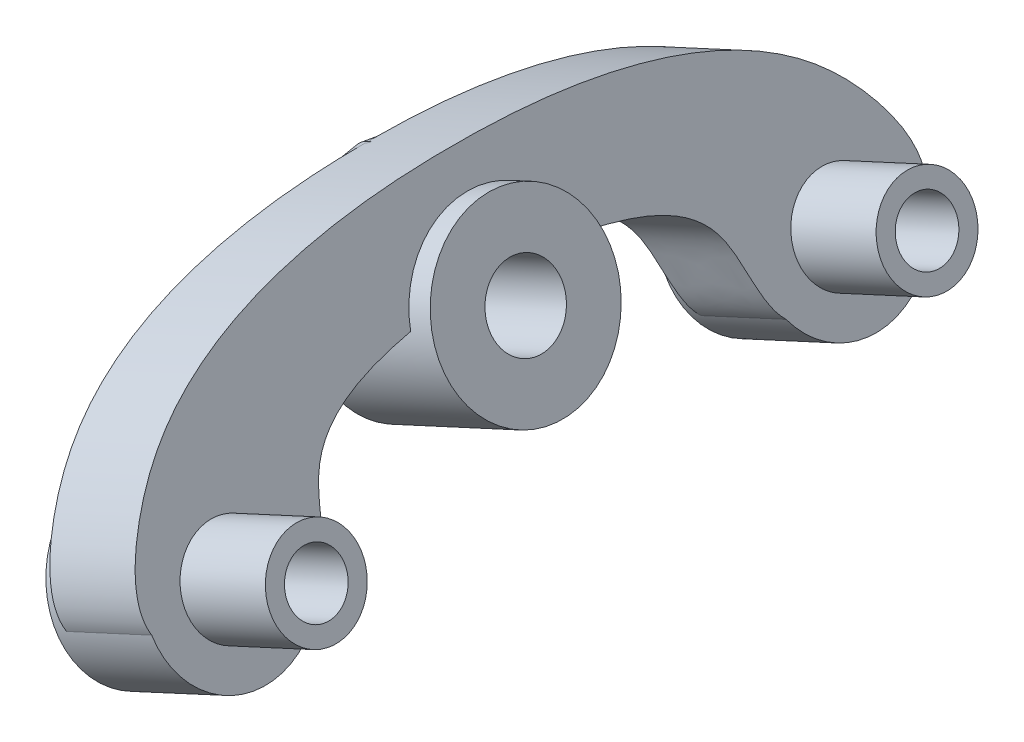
ISO-10303-21;
HEADER;
FILE_DESCRIPTION(('STEP AP214'),'2;1');
FILE_NAME('part.step','',(''),(''),'','','');
FILE_SCHEMA(('AUTOMOTIVE_DESIGN { 1 0 10303 214 1 1 1 1 }'));
ENDSEC;
DATA;
#1=APPLICATION_CONTEXT('core data for automotive mechanical design processes');
#2=APPLICATION_PROTOCOL_DEFINITION('international standard','automotive_design',2000,#1);
#3=PRODUCT_CONTEXT('',#1,'mechanical');
#4=PRODUCT('Part','Part','',(#3));
#5=PRODUCT_RELATED_PRODUCT_CATEGORY('part','',(#4));
#6=PRODUCT_DEFINITION_FORMATION('','',#4);
#7=PRODUCT_DEFINITION_CONTEXT('part definition',#1,'design');
#8=PRODUCT_DEFINITION('design','',#6,#7);
#9=PRODUCT_DEFINITION_SHAPE('','',#8);
#10=(LENGTH_UNIT() NAMED_UNIT(*) SI_UNIT(.MILLI.,.METRE.));
#11=(NAMED_UNIT(*) PLANE_ANGLE_UNIT() SI_UNIT($,.RADIAN.));
#12=(NAMED_UNIT(*) SI_UNIT($,.STERADIAN.) SOLID_ANGLE_UNIT());
#13=UNCERTAINTY_MEASURE_WITH_UNIT(LENGTH_MEASURE(1.E-05),#10,'distance_accuracy_value','');
#14=(GEOMETRIC_REPRESENTATION_CONTEXT(3) GLOBAL_UNCERTAINTY_ASSIGNED_CONTEXT((#13)) GLOBAL_UNIT_ASSIGNED_CONTEXT((#10,
#11,#12)) REPRESENTATION_CONTEXT('',''));
#15=CARTESIAN_POINT('',(0.,0.,0.));
#16=DIRECTION('',(0.,0.,1.));
#17=DIRECTION('',(1.,0.,0.));
#18=AXIS2_PLACEMENT_3D('',#15,#16,#17);
#19=CARTESIAN_POINT('',(427.544395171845,381.491929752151,-33.));
#20=CARTESIAN_POINT('',(429.18114572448,377.94563688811,-31.5159154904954));
#21=CARTESIAN_POINT('',(430.475313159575,375.141607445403,-18.2044817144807));
#22=CARTESIAN_POINT('',(425.340498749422,386.267038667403,-18.333257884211));
#23=CARTESIAN_POINT('',(423.908373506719,389.369976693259,-9.18901968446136));
#24=CARTESIAN_POINT('',(423.697685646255,389.826467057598,0.));
#25=CARTESIAN_POINT('',(423.908373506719,389.369976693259,9.18901968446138));
#26=CARTESIAN_POINT('',(425.340498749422,386.267038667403,18.333257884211));
#27=CARTESIAN_POINT('',(430.475313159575,375.141607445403,18.2044817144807));
#28=CARTESIAN_POINT('',(428.731583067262,378.919689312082,36.1399875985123));
#29=CARTESIAN_POINT('',(424.078552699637,389.001255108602,30.9280904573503));
#30=CARTESIAN_POINT('',(421.714104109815,394.124227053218,23.7008760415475));
#31=CARTESIAN_POINT('',(420.404830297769,396.960986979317,12.5144980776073));
#32=CARTESIAN_POINT('',(420.108002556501,397.604113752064,0.));
#33=CARTESIAN_POINT('',(420.404830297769,396.960986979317,-12.5144980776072));
#34=CARTESIAN_POINT('',(421.714104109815,394.124227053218,-23.7008760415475));
#35=CARTESIAN_POINT('',(424.078552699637,389.001255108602,-30.9280904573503));
#36=CARTESIAN_POINT('',(426.651273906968,383.427025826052,-33.8098163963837));
#37=CARTESIAN_POINT('',(427.544395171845,381.491929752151,-33.));
#38=B_SPLINE_CURVE_WITH_KNOTS('',3,(#19,#20,#21,#22,#23,#24,#25,#26,#27,#28,#29,#30,#31,#32,#33,
#34,#35,#36,#37),.UNSPECIFIED.,.T.,.F.,(4,1,1,1,1,1,1,1,1,1,1,1,1,1,1,1,4),(0.,
0.083228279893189,0.130737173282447,0.181031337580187,0.243724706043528,0.306418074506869,
0.356712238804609,0.404221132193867,0.487449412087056,0.532864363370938,0.590377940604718,
0.662388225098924,0.743724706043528,0.825061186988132,0.897071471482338,0.954585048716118,1.),.UNSPECIFIED.);
#39=DIRECTION('',(0.907959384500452,0.419058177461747,0.));
#40=VECTOR('',#39,1.);
#41=SURFACE_OF_LINEAR_EXTRUSION('',#38,#40);
#42=CARTESIAN_POINT('',(434.808070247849,384.844395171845,-33.));
#43=CARTESIAN_POINT('',(436.444820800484,381.298102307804,-31.5159154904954));
#44=CARTESIAN_POINT('',(437.738988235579,378.494072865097,-18.2044817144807));
#45=CARTESIAN_POINT('',(432.604173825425,389.619504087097,-18.333257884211));
#46=CARTESIAN_POINT('',(431.172048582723,392.722442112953,-9.18901968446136));
#47=CARTESIAN_POINT('',(430.961360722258,393.178932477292,0.));
#48=CARTESIAN_POINT('',(431.172048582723,392.722442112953,9.18901968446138));
#49=CARTESIAN_POINT('',(432.604173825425,389.619504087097,18.333257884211));
#50=CARTESIAN_POINT('',(437.738988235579,378.494072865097,18.2044817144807));
#51=CARTESIAN_POINT('',(435.995258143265,382.272154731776,36.1399875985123));
#52=CARTESIAN_POINT('',(431.342227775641,392.353720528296,30.9280904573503));
#53=CARTESIAN_POINT('',(428.977779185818,397.476692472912,23.7008760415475));
#54=CARTESIAN_POINT('',(427.668505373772,400.313452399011,12.5144980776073));
#55=CARTESIAN_POINT('',(427.371677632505,400.956579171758,0.));
#56=CARTESIAN_POINT('',(427.668505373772,400.313452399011,-12.5144980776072));
#57=CARTESIAN_POINT('',(428.977779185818,397.476692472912,-23.7008760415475));
#58=CARTESIAN_POINT('',(431.342227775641,392.353720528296,-30.9280904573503));
#59=CARTESIAN_POINT('',(433.914948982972,386.779491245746,-33.8098163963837));
#60=CARTESIAN_POINT('',(434.808070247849,384.844395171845,-33.));
#61=B_SPLINE_CURVE_WITH_KNOTS('',3,(#42,#43,#44,#45,#46,#47,#48,#49,#50,#51,#52,#53,#54,#55,#56,
#57,#58,#59,#60),.UNSPECIFIED.,.T.,.F.,(4,1,1,1,1,1,1,1,1,1,1,1,1,1,1,1,4),(0.,
0.083228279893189,0.130737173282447,0.181031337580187,0.243724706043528,0.306418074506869,
0.356712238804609,0.404221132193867,0.487449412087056,0.532864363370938,0.590377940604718,
0.662388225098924,0.743724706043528,0.825061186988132,0.897071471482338,0.954585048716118,1.),.UNSPECIFIED.);
#62=CARTESIAN_POINT('',(431.238414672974,392.578648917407,7.34471380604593));
#63=VERTEX_POINT('',#62);
#64=CARTESIAN_POINT('',(436.00615270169,382.248549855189,19.8585671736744));
#65=VERTEX_POINT('',#64);
#66=EDGE_CURVE('E226',#63,#65,#61,.T.);
#67=ORIENTED_EDGE('',*,*,#66,.T.);
#68=DIRECTION('',(0.907959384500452,0.419058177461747,0.));
#69=VECTOR('',#68,1.);
#70=CARTESIAN_POINT('',(428.742477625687,378.896084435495,19.8585671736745));
#71=LINE('',#70,#69);
#72=CARTESIAN_POINT('',(428.742477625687,378.896084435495,19.8585671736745));
#73=VERTEX_POINT('',#72);
#74=EDGE_CURVE('E224',#65,#73,#71,.F.);
#75=ORIENTED_EDGE('',*,*,#74,.T.);
#76=CARTESIAN_POINT('',(423.97473959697,389.226183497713,7.34471380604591));
#77=VERTEX_POINT('',#76);
#78=EDGE_CURVE('E213',#77,#73,#38,.T.);
#79=ORIENTED_EDGE('',*,*,#78,.F.);
#80=DIRECTION('',(0.907959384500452,0.419058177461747,0.));
#81=VECTOR('',#80,1.);
#82=CARTESIAN_POINT('',(423.974739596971,389.226183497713,7.34471380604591));
#83=LINE('',#82,#81);
#84=EDGE_CURVE('E277',#77,#63,#83,.T.);
#85=ORIENTED_EDGE('',*,*,#84,.T.);
#86=EDGE_LOOP('',(#67,#75,#79,#85));
#87=FACE_BOUND('',#86,.T.);
#88=ADVANCED_FACE('F121',(#87),#41,.F.);
#89=CARTESIAN_POINT('',(427.568265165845,381.440211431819,32.9778072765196));
#90=VERTEX_POINT('',#89);
#91=CARTESIAN_POINT('',(420.210935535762,397.381092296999,0.178646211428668));
#92=VERTEX_POINT('',#91);
#93=EDGE_CURVE('E221',#90,#92,#38,.T.);
#94=ORIENTED_EDGE('',*,*,#93,.F.);
#95=DIRECTION('',(0.907959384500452,0.419058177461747,0.));
#96=VECTOR('',#95,1.);
#97=CARTESIAN_POINT('',(427.568265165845,381.440211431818,32.9778072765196));
#98=LINE('',#97,#96);
#99=CARTESIAN_POINT('',(434.831940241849,384.792676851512,32.9778072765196));
#100=VERTEX_POINT('',#99);
#101=EDGE_CURVE('E147',#90,#100,#98,.T.);
#102=ORIENTED_EDGE('',*,*,#101,.T.);
#103=CARTESIAN_POINT('',(434.831940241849,384.792676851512,-32.9778072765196));
#104=VERTEX_POINT('',#103);
#105=EDGE_CURVE('E349',#100,#104,#61,.T.);
#106=ORIENTED_EDGE('',*,*,#105,.T.);
#107=DIRECTION('',(0.907959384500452,0.419058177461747,0.));
#108=VECTOR('',#107,1.);
#109=CARTESIAN_POINT('',(427.568265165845,381.440211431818,-32.9778072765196));
#110=LINE('',#109,#108);
#111=CARTESIAN_POINT('',(427.568265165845,381.440211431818,-32.9778072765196));
#112=VERTEX_POINT('',#111);
#113=EDGE_CURVE('E260',#104,#112,#110,.F.);
#114=ORIENTED_EDGE('',*,*,#113,.T.);
#115=CARTESIAN_POINT('',(420.210935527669,397.381092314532,-0.178646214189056));
#116=VERTEX_POINT('',#115);
#117=EDGE_CURVE('E222',#116,#112,#38,.T.);
#118=ORIENTED_EDGE('',*,*,#117,.F.);
#119=CARTESIAN_POINT('',(420.605690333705,397.563400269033,0.0915100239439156));
#120=CARTESIAN_POINT('',(420.596043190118,397.55895935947,0.0783232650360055));
#121=CARTESIAN_POINT('',(420.586185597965,397.554418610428,0.0653228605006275));
#122=CARTESIAN_POINT('',(420.565985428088,397.54510834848,0.0397654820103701));
#123=CARTESIAN_POINT('',(420.555642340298,397.540338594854,0.027208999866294));
#124=CARTESIAN_POINT('',(420.52318154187,397.525362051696,-0.0103858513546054));
#125=CARTESIAN_POINT('',(420.500206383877,397.514752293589,-0.034543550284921));
#126=CARTESIAN_POINT('',(420.451267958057,397.492140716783,-0.079496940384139));
#127=CARTESIAN_POINT('',(420.425282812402,397.480128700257,-0.100264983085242));
#128=CARTESIAN_POINT('',(420.384159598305,397.461118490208,-0.126908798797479));
#129=CARTESIAN_POINT('',(420.370204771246,397.45466746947,-0.13499525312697));
#130=CARTESIAN_POINT('',(420.341575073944,397.441434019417,-0.149394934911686));
#131=CARTESIAN_POINT('',(420.326901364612,397.434652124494,-0.155710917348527));
#132=CARTESIAN_POINT('',(420.295668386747,397.420219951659,-0.166644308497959));
#133=CARTESIAN_POINT('',(420.279053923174,397.412544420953,-0.171076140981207));
#134=CARTESIAN_POINT('',(420.245287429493,397.39694969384,-0.177109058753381));
#135=CARTESIAN_POINT('',(420.228132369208,397.389029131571,-0.178689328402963));
#136=CARTESIAN_POINT('',(420.210935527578,397.381092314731,-0.17864607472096));
#137=B_SPLINE_CURVE_WITH_KNOTS('',3,(#119,#120,#121,#122,#123,#124,#125,#126,#127,#128,#129,
#130,#131,#132,#133,#134,#135,#136),.UNSPECIFIED.,.F.,.F.,(4,2,2,2,2,2,2,2,4),(0.,
0.0507919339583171,0.101638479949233,0.206393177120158,0.31196370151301,0.363987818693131,
0.415930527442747,0.472204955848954,0.52888853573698),.UNSPECIFIED.);
#138=CARTESIAN_POINT('',(420.531889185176,397.529378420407,1.01524226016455E-12));
#139=VERTEX_POINT('',#138);
#140=EDGE_CURVE('E322',#139,#116,#137,.T.);
#141=ORIENTED_EDGE('',*,*,#140,.F.);
#142=CARTESIAN_POINT('',(420.210935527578,397.381092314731,0.178646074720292));
#143=CARTESIAN_POINT('',(420.221178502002,397.385819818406,0.178650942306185));
#144=CARTESIAN_POINT('',(420.231414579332,397.390545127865,0.178099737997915));
#145=CARTESIAN_POINT('',(420.251777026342,397.399946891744,0.175931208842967));
#146=CARTESIAN_POINT('',(420.261903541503,397.404623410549,0.17431553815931));
#147=CARTESIAN_POINT('',(420.29164390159,397.418360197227,0.168018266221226));
#148=CARTESIAN_POINT('',(420.31101066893,397.427308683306,0.161882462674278));
#149=CARTESIAN_POINT('',(420.354295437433,397.4473127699,0.144036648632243));
#150=CARTESIAN_POINT('',(420.377819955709,397.458187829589,0.131202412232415));
#151=CARTESIAN_POINT('',(420.423015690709,397.479080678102,0.101522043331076));
#152=CARTESIAN_POINT('',(420.44465837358,397.489085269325,0.0846252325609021));
#153=CARTESIAN_POINT('',(420.491821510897,397.510879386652,0.0430204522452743));
#154=CARTESIAN_POINT('',(420.51670950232,397.522374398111,0.0174544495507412));
#155=CARTESIAN_POINT('',(420.551767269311,397.538551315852,-0.0225723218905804));
#156=CARTESIAN_POINT('',(420.562942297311,397.543705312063,-0.0360082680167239));
#157=CARTESIAN_POINT('',(420.584720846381,397.553743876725,-0.0633943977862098));
#158=CARTESIAN_POINT('',(420.595325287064,397.558628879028,-0.0773436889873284));
#159=CARTESIAN_POINT('',(420.605690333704,397.563400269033,-0.0915100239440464));
#160=B_SPLINE_CURVE_WITH_KNOTS('',3,(#142,#143,#144,#145,#146,#147,#148,#149,#150,#151,#152,
#153,#154,#155,#156,#157,#158,#159),.UNSPECIFIED.,.F.,.F.,(4,2,2,2,2,2,2,2,4),(0.,
0.0338175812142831,0.0675827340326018,0.133837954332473,0.220117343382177,0.307534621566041,
0.419654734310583,0.474304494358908,0.52886336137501),.UNSPECIFIED.);
#161=EDGE_CURVE('E329',#92,#139,#160,.T.);
#162=ORIENTED_EDGE('',*,*,#161,.F.);
#163=EDGE_LOOP('',(#94,#102,#106,#114,#118,#141,#162));
#164=FACE_BOUND('',#163,.T.);
#165=ADVANCED_FACE('F373',(#164),#41,.F.);
#166=CARTESIAN_POINT('',(426.758452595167,383.194805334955,33.2328245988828));
#167=DIRECTION('',(-0.907959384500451,-0.419058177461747,0.));
#168=DIRECTION('',(0.419058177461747,-0.907959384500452,0.));
#169=AXIS2_PLACEMENT_3D('',#166,#167,#168);
#170=PLANE('',#169);
#171=CARTESIAN_POINT('',(423.353813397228,390.571523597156,19.12));
#172=DIRECTION('',(-0.907959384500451,-0.419058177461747,0.));
#173=DIRECTION('',(0.419058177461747,-0.907959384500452,0.));
#174=AXIS2_PLACEMENT_3D('',#171,#172,#173);
#175=CIRCLE('',#174,1.25);
#176=CARTESIAN_POINT('',(423.877636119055,389.43657436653,19.12));
#177=VERTEX_POINT('',#176);
#178=EDGE_CURVE('E431',#177,#177,#175,.F.);
#179=ORIENTED_EDGE('',*,*,#178,.T.);
#180=EDGE_LOOP('',(#179));
#181=FACE_BOUND('',#180,.T.);
#182=CARTESIAN_POINT('',(427.334866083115,381.945909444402,26.));
#183=DIRECTION('',(-0.907959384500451,-0.419058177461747,0.));
#184=DIRECTION('',(0.419058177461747,-0.907959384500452,0.));
#185=AXIS2_PLACEMENT_3D('',#182,#183,#184);
#186=CIRCLE('',#185,7.);
#187=EDGE_CURVE('E140',#90,#73,#186,.T.);
#188=ORIENTED_EDGE('',*,*,#187,.F.);
#189=ORIENTED_EDGE('',*,*,#93,.T.);
#190=DIRECTION('',(0.0592637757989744,-0.128404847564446,0.989949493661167));
#191=VECTOR('',#190,1.);
#192=CARTESIAN_POINT('',(420.174952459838,397.459055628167,-0.422419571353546));
#193=LINE('',#192,#191);
#194=CARTESIAN_POINT('',(421.059522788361,395.542486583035,14.3535533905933));
#195=VERTEX_POINT('',#194);
#196=EDGE_CURVE('E313',#92,#195,#193,.T.);
#197=ORIENTED_EDGE('',*,*,#196,.T.);
#198=DIRECTION('',(0.414846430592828,-0.898833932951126,-0.141421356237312));
#199=VECTOR('',#198,1.);
#200=CARTESIAN_POINT('',(425.536862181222,385.84158456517,12.8272261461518));
#201=LINE('',#200,#199);
#202=CARTESIAN_POINT('',(423.133754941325,391.048316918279,13.6464466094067));
#203=VERTEX_POINT('',#202);
#204=EDGE_CURVE('E361',#195,#203,#201,.T.);
#205=ORIENTED_EDGE('',*,*,#204,.T.);
#206=DIRECTION('',(0.0592637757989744,-0.128404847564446,0.989949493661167));
#207=VECTOR('',#206,1.);
#208=CARTESIAN_POINT('',(422.249184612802,392.964885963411,-1.12952635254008));
#209=LINE('',#208,#207);
#210=CARTESIAN_POINT('',(422.669934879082,392.053260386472,5.89873850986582));
#211=VERTEX_POINT('',#210);
#212=EDGE_CURVE('E360',#203,#211,#209,.F.);
#213=ORIENTED_EDGE('',*,*,#212,.T.);
#214=CARTESIAN_POINT('',(424.610987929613,387.847645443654,0.));
#215=DIRECTION('',(-0.907959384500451,-0.419058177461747,0.));
#216=DIRECTION('',(0.419058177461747,-0.907959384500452,0.));
#217=AXIS2_PLACEMENT_3D('',#214,#215,#216);
#218=CIRCLE('',#217,7.5);
#219=EDGE_CURVE('E217',#77,#211,#218,.T.);
#220=ORIENTED_EDGE('',*,*,#219,.F.);
#221=ORIENTED_EDGE('',*,*,#78,.T.);
#222=EDGE_LOOP('',(#188,#189,#197,#205,#213,#220,#221));
#223=FACE_BOUND('',#222,.T.);
#224=ADVANCED_FACE('F215',(#181,#223),#170,.T.);
#225=CARTESIAN_POINT('',(421.21206853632,395.211970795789,-0.775972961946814));
#226=DIRECTION('',(0.0592637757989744,-0.128404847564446,0.989949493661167));
#227=DIRECTION('',(0.,-0.991692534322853,-0.128630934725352));
#228=AXIS2_PLACEMENT_3D('',#225,#226,#227);
#229=CYLINDRICAL_SURFACE('',#228,2.49999999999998);
#230=DIRECTION('',(0.0592637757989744,-0.128404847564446,0.989949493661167));
#231=VECTOR('',#230,1.);
#232=CARTESIAN_POINT('',(420.018419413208,393.025603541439,-0.98810499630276));
#233=LINE('',#232,#231);
#234=CARTESIAN_POINT('',(420.361746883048,392.281727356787,4.7468798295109));
#235=VERTEX_POINT('',#234);
#236=CARTESIAN_POINT('',(420.077572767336,392.89743794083,0.));
#237=VERTEX_POINT('',#236);
#238=EDGE_CURVE('E288',#235,#237,#233,.F.);
#239=ORIENTED_EDGE('',*,*,#238,.F.);
#240=CARTESIAN_POINT('',(420.361746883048,392.281727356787,4.74687982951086));
#241=CARTESIAN_POINT('',(420.408475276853,392.250540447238,4.80549104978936));
#242=CARTESIAN_POINT('',(420.457372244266,392.219923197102,4.86273234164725));
#243=CARTESIAN_POINT('',(420.559752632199,392.160515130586,4.97420901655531));
#244=CARTESIAN_POINT('',(420.61324523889,392.131728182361,5.02843800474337));
#245=CARTESIAN_POINT('',(420.725389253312,392.07654918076,5.13386331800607));
#246=CARTESIAN_POINT('',(420.784083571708,392.050181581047,5.18502717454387));
#247=CARTESIAN_POINT('',(420.90613580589,392.001083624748,5.28326637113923));
#248=CARTESIAN_POINT('',(420.969489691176,391.978350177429,5.33034516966));
#249=CARTESIAN_POINT('',(421.132296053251,391.927671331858,5.4415033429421));
#250=CARTESIAN_POINT('',(421.234488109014,391.902455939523,5.50290629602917));
#251=CARTESIAN_POINT('',(421.44715181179,391.865653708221,5.6139081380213));
#252=CARTESIAN_POINT('',(421.557595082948,391.854022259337,5.66354523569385));
#253=CARTESIAN_POINT('',(421.727932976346,391.849052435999,5.72827305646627));
#254=CARTESIAN_POINT('',(421.785834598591,391.84951439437,5.74831350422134));
#255=CARTESIAN_POINT('',(421.902526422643,391.85501126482,5.78482843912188));
#256=CARTESIAN_POINT('',(421.96131614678,391.860043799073,5.80130477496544));
#257=CARTESIAN_POINT('',(422.079240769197,391.874932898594,5.83053520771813));
#258=CARTESIAN_POINT('',(422.138375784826,391.884791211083,5.84328795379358));
#259=CARTESIAN_POINT('',(422.256297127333,391.909449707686,5.86493145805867));
#260=CARTESIAN_POINT('',(422.315083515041,391.924249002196,5.87382291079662));
#261=CARTESIAN_POINT('',(422.473054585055,391.97110672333,5.89255089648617));
#262=CARTESIAN_POINT('',(422.571341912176,392.007963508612,5.89859092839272));
#263=CARTESIAN_POINT('',(422.761544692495,392.095341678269,5.89888081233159));
#264=CARTESIAN_POINT('',(422.853463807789,392.145855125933,5.89313749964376));
#265=CARTESIAN_POINT('',(423.022236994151,392.2547536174,5.87086209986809));
#266=CARTESIAN_POINT('',(423.099690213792,392.312371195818,5.85508912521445));
#267=CARTESIAN_POINT('',(423.245044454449,392.435596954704,5.81391702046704));
#268=CARTESIAN_POINT('',(423.312945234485,392.501205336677,5.78851764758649));
#269=CARTESIAN_POINT('',(423.441301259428,392.641220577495,5.72731986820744));
#270=CARTESIAN_POINT('',(423.501252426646,392.715896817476,5.69108641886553));
#271=CARTESIAN_POINT('',(423.609634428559,392.86861937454,5.60969839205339));
#272=CARTESIAN_POINT('',(423.658059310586,392.946667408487,5.56453922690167));
#273=CARTESIAN_POINT('',(423.763257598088,393.139017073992,5.44421636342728));
#274=CARTESIAN_POINT('',(423.814028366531,393.253872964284,5.36468134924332));
#275=CARTESIAN_POINT('',(423.896017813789,393.480227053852,5.19191056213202));
#276=CARTESIAN_POINT('',(423.927196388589,393.591717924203,5.09864716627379));
#277=CARTESIAN_POINT('',(423.967820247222,393.779229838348,4.9273397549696));
#278=CARTESIAN_POINT('',(423.980832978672,393.856831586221,4.85179659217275));
#279=CARTESIAN_POINT('',(424.000032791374,394.007660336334,4.69559787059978));
#280=CARTESIAN_POINT('',(424.006216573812,394.080885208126,4.61493986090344));
#281=CARTESIAN_POINT('',(424.013178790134,394.222589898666,4.44914174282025));
#282=CARTESIAN_POINT('',(424.013948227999,394.291061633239,4.363994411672));
#283=CARTESIAN_POINT('',(424.011313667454,394.422944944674,4.18991431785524));
#284=CARTESIAN_POINT('',(424.00790826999,394.48635481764,4.10098029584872));
#285=CARTESIAN_POINT('',(423.995140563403,394.643469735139,3.86707840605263));
#286=CARTESIAN_POINT('',(423.983464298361,394.733316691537,3.71963540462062));
#287=CARTESIAN_POINT('',(423.955926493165,394.900307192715,3.41807532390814));
#288=CARTESIAN_POINT('',(423.940062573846,394.977443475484,3.26395449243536));
#289=CARTESIAN_POINT('',(423.906811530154,395.119386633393,2.95020579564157));
#290=CARTESIAN_POINT('',(423.889423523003,395.184186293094,2.79057477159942));
#291=CARTESIAN_POINT('',(423.855137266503,395.301757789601,2.46694055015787));
#292=CARTESIAN_POINT('',(423.838238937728,395.354531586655,2.30293807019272));
#293=CARTESIAN_POINT('',(423.80560327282,395.450533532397,1.96372522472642));
#294=CARTESIAN_POINT('',(423.789956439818,395.493203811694,1.78834827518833));
#295=CARTESIAN_POINT('',(423.761743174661,395.565867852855,1.43473820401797));
#296=CARTESIAN_POINT('',(423.749176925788,395.59586086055,1.25650491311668));
#297=CARTESIAN_POINT('',(423.72748794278,395.643185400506,0.897851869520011));
#298=CARTESIAN_POINT('',(423.718370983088,395.660495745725,0.717428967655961));
#299=CARTESIAN_POINT('',(423.703379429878,395.682153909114,0.355678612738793));
#300=CARTESIAN_POINT('',(423.697504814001,395.686501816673,0.174351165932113));
#301=CARTESIAN_POINT('',(423.687479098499,395.68147490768,-0.214938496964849));
#302=CARTESIAN_POINT('',(423.683709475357,395.669983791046,-0.422888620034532));
#303=CARTESIAN_POINT('',(423.677050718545,395.628462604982,-0.837078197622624));
#304=CARTESIAN_POINT('',(423.674162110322,395.598421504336,-1.04331656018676));
#305=CARTESIAN_POINT('',(423.665771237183,395.518761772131,-1.45112948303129));
#306=CARTESIAN_POINT('',(423.660280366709,395.469228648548,-1.65272039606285));
#307=CARTESIAN_POINT('',(423.646381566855,395.379442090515,-1.94998626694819));
#308=CARTESIAN_POINT('',(423.640808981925,395.346951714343,-2.04817481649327));
#309=CARTESIAN_POINT('',(423.626984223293,395.276698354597,-2.24244238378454));
#310=CARTESIAN_POINT('',(423.618732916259,395.238937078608,-2.3385220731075));
#311=CARTESIAN_POINT('',(423.600484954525,395.165429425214,-2.51081459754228));
#312=CARTESIAN_POINT('',(423.591078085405,395.130564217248,-2.58746441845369));
#313=CARTESIAN_POINT('',(423.569321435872,395.057300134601,-2.7386046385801));
#314=CARTESIAN_POINT('',(423.556971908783,395.018901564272,-2.81309522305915));
#315=CARTESIAN_POINT('',(423.514613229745,394.898516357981,-3.03263386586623));
#316=CARTESIAN_POINT('',(423.479276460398,394.811257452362,-3.17394438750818));
#317=CARTESIAN_POINT('',(423.395692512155,394.638413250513,-3.42203952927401));
#318=CARTESIAN_POINT('',(423.350105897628,394.554466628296,-3.5308461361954));
#319=CARTESIAN_POINT('',(423.241296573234,394.380449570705,-3.73387908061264));
#320=CARTESIAN_POINT('',(423.178099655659,394.290388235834,-3.82812643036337));
#321=CARTESIAN_POINT('',(423.048023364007,394.128986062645,-3.9786442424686));
#322=CARTESIAN_POINT('',(422.985133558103,394.057966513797,-4.03869340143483));
#323=CARTESIAN_POINT('',(422.846888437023,393.917788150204,-4.14520780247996));
#324=CARTESIAN_POINT('',(422.77153831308,393.848628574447,-4.19167867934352));
#325=CARTESIAN_POINT('',(422.608581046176,393.71501319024,-4.26931669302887));
#326=CARTESIAN_POINT('',(422.52089779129,393.650590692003,-4.30038292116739));
#327=CARTESIAN_POINT('',(422.335767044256,393.530300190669,-4.34524537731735));
#328=CARTESIAN_POINT('',(422.238324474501,393.474427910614,-4.35905026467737));
#329=CARTESIAN_POINT('',(422.047956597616,393.379355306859,-4.36819771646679));
#330=CARTESIAN_POINT('',(421.955688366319,393.339003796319,-4.36538100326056));
#331=CARTESIAN_POINT('',(421.768871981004,393.268302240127,-4.34562496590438));
#332=CARTESIAN_POINT('',(421.674323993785,393.237951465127,-4.32868667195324));
#333=CARTESIAN_POINT('',(421.488150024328,393.188119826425,-4.28193094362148));
#334=CARTESIAN_POINT('',(421.396508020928,393.168397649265,-4.25242933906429));
#335=CARTESIAN_POINT('',(421.21638737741,393.13823098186,-4.18169836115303));
#336=CARTESIAN_POINT('',(421.127907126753,393.127781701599,-4.14047505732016));
#337=CARTESIAN_POINT('',(420.949042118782,393.114558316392,-4.04385142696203));
#338=CARTESIAN_POINT('',(420.859084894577,393.112475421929,-3.98757245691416));
#339=CARTESIAN_POINT('',(420.68651671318,393.116109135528,-3.86449602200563));
#340=CARTESIAN_POINT('',(420.603929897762,393.121850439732,-3.79766584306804));
#341=CARTESIAN_POINT('',(420.462292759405,393.13757517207,-3.66906710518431));
#342=CARTESIAN_POINT('',(420.401762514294,393.146536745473,-3.60877668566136));
#343=CARTESIAN_POINT('',(420.28632848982,393.167366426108,-3.48337914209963));
#344=CARTESIAN_POINT('',(420.23143139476,393.179237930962,-3.41826645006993));
#345=CARTESIAN_POINT('',(420.127673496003,393.204896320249,-3.28456216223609));
#346=CARTESIAN_POINT('',(420.078771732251,393.218668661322,-3.21599928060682));
#347=CARTESIAN_POINT('',(419.986437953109,393.247421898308,-3.07577282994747));
#348=CARTESIAN_POINT('',(419.942992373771,393.262399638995,-3.00411756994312));
#349=CARTESIAN_POINT('',(419.902098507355,393.277632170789,-2.9311438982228));
#350=B_SPLINE_CURVE_WITH_KNOTS('',3,(#240,#241,#242,#243,#244,#245,#246,#247,#248,#249,#250,
#251,#252,#253,#254,#255,#256,#257,#258,#259,#260,#261,#262,#263,#264,#265,#266,#267,#268,#269,
#270,#271,#272,#273,#274,#275,#276,#277,#278,#279,#280,#281,#282,#283,#284,#285,#286,#287,#288,
#289,#290,#291,#292,#293,#294,#295,#296,#297,#298,#299,#300,#301,#302,#303,#304,#305,#306,#307,
#308,#309,#310,#311,#312,#313,#314,#315,#316,#317,#318,#319,#320,#321,#322,#323,#324,#325,#326,
#327,#328,#329,#330,#331,#332,#333,#334,#335,#336,#337,#338,#339,#340,#341,#342,#343,#344,#345,
#346,#347,#348,#349),.UNSPECIFIED.,.F.,.F.,(4,2,2,2,2,2,2,2,2,2,2,2,2,2,2,2,2,2,2,2,2,2,2,2,2,2,
2,2,2,2,2,2,2,2,2,2,2,2,2,2,2,2,2,2,2,2,2,2,2,2,2,2,2,2,4),(0.,0.243580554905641,
0.487659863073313,0.733983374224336,0.980096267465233,1.34425376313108,1.70721196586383,
1.89079510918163,2.07428279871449,2.25783697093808,2.44135811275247,2.75494850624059,
3.06835704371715,3.36048309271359,3.65261650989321,3.95856763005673,4.26467641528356,
4.70812885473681,5.1524860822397,5.47928935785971,5.80625043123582,6.13375462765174,
6.46136860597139,6.97973995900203,7.49840645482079,8.01737538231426,8.53625965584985,
9.07926797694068,9.6223085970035,10.1662543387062,10.7101963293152,11.3342829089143,
11.9587409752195,12.5804896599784,12.8910611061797,13.2015321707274,13.4555749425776,
13.7095958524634,14.2170026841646,14.6498393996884,15.0820454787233,15.4175221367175,
15.7528593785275,16.0903651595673,16.4277015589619,16.7284353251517,17.0291471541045,
17.3227083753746,17.6161178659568,17.9333237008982,18.2515330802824,18.5088576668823,
18.766484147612,19.0222387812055,19.2773444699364),.UNSPECIFIED.);
#351=EDGE_CURVE('E279',#235,#211,#350,.T.);
#352=ORIENTED_EDGE('',*,*,#351,.T.);
#353=ORIENTED_EDGE('',*,*,#212,.F.);
#354=CARTESIAN_POINT('',(422.096638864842,393.295401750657,14.));
#355=DIRECTION('',(-0.0592637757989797,0.128404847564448,-0.989949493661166));
#356=DIRECTION('',(0.,0.991692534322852,0.128630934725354));
#357=AXIS2_PLACEMENT_3D('',#354,#355,#356);
#358=CIRCLE('',#357,2.49999999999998);
#359=EDGE_CURVE('E331',#203,#195,#358,.T.);
#360=ORIENTED_EDGE('',*,*,#359,.T.);
#361=ORIENTED_EDGE('',*,*,#196,.F.);
#362=ORIENTED_EDGE('',*,*,#161,.T.);
#363=CARTESIAN_POINT('',(421.258522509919,395.111320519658,0.));
#364=DIRECTION('',(0.,0.,1.));
#365=DIRECTION('',(-0.419058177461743,0.907959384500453,0.));
#366=AXIS2_PLACEMENT_3D('',#363,#364,#365);
#367=ELLIPSE('',#366,2.5253813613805,2.49999999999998);
#368=EDGE_CURVE('E330',#139,#237,#367,.T.);
#369=ORIENTED_EDGE('',*,*,#368,.T.);
#370=EDGE_LOOP('',(#239,#352,#353,#360,#361,#362,#369));
#371=FACE_BOUND('',#370,.T.);
#372=ADVANCED_FACE('F290',(#371),#229,.T.);
#373=CARTESIAN_POINT('',(422.096638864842,393.295401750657,-14.));
#374=DIRECTION('',(-0.0592637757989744,0.128404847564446,0.989949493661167));
#375=DIRECTION('',(0.,-0.991692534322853,0.128630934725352));
#376=AXIS2_PLACEMENT_3D('',#373,#374,#375);
#377=CYLINDRICAL_SURFACE('',#376,2.49999999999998);
#378=DIRECTION('',(-0.0592637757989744,0.128404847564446,0.989949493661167));
#379=VECTOR('',#378,1.);
#380=CARTESIAN_POINT('',(420.902989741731,391.109034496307,-13.787867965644));
#381=LINE('',#380,#379);
#382=CARTESIAN_POINT('',(420.361746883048,392.281727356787,-4.74687982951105));
#383=VERTEX_POINT('',#382);
#384=EDGE_CURVE('E12',#237,#383,#381,.F.);
#385=ORIENTED_EDGE('',*,*,#384,.F.);
#386=ORIENTED_EDGE('',*,*,#368,.F.);
#387=ORIENTED_EDGE('',*,*,#140,.T.);
#388=DIRECTION('',(-0.0592637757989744,0.128404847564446,0.989949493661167));
#389=VECTOR('',#388,1.);
#390=CARTESIAN_POINT('',(421.059522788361,395.542486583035,-14.3535533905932));
#391=LINE('',#390,#389);
#392=CARTESIAN_POINT('',(421.059522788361,395.542486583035,-14.3535533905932));
#393=VERTEX_POINT('',#392);
#394=EDGE_CURVE('E342',#393,#116,#391,.T.);
#395=ORIENTED_EDGE('',*,*,#394,.F.);
#396=CARTESIAN_POINT('',(422.096638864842,393.295401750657,-14.));
#397=DIRECTION('',(0.059263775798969,-0.128404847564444,-0.989949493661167));
#398=DIRECTION('',(0.,0.991692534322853,-0.12863093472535));
#399=AXIS2_PLACEMENT_3D('',#396,#397,#398);
#400=CIRCLE('',#399,2.49999999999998);
#401=CARTESIAN_POINT('',(423.133754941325,391.048316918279,-13.6464466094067));
#402=VERTEX_POINT('',#401);
#403=EDGE_CURVE('E385',#402,#393,#400,.T.);
#404=ORIENTED_EDGE('',*,*,#403,.F.);
#405=DIRECTION('',(-0.0592637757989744,0.128404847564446,0.989949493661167));
#406=VECTOR('',#405,1.);
#407=CARTESIAN_POINT('',(423.133754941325,391.048316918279,-13.6464466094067));
#408=LINE('',#407,#406);
#409=CARTESIAN_POINT('',(422.669934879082,392.053260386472,-5.89873850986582));
#410=VERTEX_POINT('',#409);
#411=EDGE_CURVE('E358',#410,#402,#408,.F.);
#412=ORIENTED_EDGE('',*,*,#411,.F.);
#413=CARTESIAN_POINT('',(419.902098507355,393.277632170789,2.93114389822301));
#414=CARTESIAN_POINT('',(419.941146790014,393.263085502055,3.00082221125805));
#415=CARTESIAN_POINT('',(419.982517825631,393.248774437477,3.06929502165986));
#416=CARTESIAN_POINT('',(420.070194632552,393.221224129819,3.20342879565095));
#417=CARTESIAN_POINT('',(420.116510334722,393.207987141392,3.26908371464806));
#418=CARTESIAN_POINT('',(420.214656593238,393.183136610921,3.39747865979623));
#419=CARTESIAN_POINT('',(420.266533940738,393.171539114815,3.46018633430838));
#420=CARTESIAN_POINT('',(420.375454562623,393.150892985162,3.58129922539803));
#421=CARTESIAN_POINT('',(420.432493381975,393.141842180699,3.63970807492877));
#422=CARTESIAN_POINT('',(420.580341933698,393.123571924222,3.77840702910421));
#423=CARTESIAN_POINT('',(420.674227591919,393.116353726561,3.85575517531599));
#424=CARTESIAN_POINT('',(420.871812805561,393.112221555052,3.99662629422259));
#425=CARTESIAN_POINT('',(420.975479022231,393.115273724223,4.06019395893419));
#426=CARTESIAN_POINT('',(421.136949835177,393.129515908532,4.14358295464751));
#427=CARTESIAN_POINT('',(421.19210029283,393.13593872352,4.16949830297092));
#428=CARTESIAN_POINT('',(421.303771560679,393.152313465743,4.21684736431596));
#429=CARTESIAN_POINT('',(421.360291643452,393.162263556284,4.23828340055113));
#430=CARTESIAN_POINT('',(421.474184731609,393.185887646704,4.27639621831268));
#431=CARTESIAN_POINT('',(421.53155803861,393.199562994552,4.29307127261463));
#432=CARTESIAN_POINT('',(421.646486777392,393.230705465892,4.32141659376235));
#433=CARTESIAN_POINT('',(421.704042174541,393.248171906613,4.3330877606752));
#434=CARTESIAN_POINT('',(421.859419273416,393.300649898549,4.35768979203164));
#435=CARTESIAN_POINT('',(421.956868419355,393.339322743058,4.36565084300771));
#436=CARTESIAN_POINT('',(422.147030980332,393.426788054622,4.36603278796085));
#437=CARTESIAN_POINT('',(422.239747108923,393.475574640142,4.35846269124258));
#438=CARTESIAN_POINT('',(422.411605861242,393.577787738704,4.32919641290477));
#439=CARTESIAN_POINT('',(422.491242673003,393.630674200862,4.30849439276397));
#440=CARTESIAN_POINT('',(422.6422823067,393.741581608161,4.254696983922));
#441=CARTESIAN_POINT('',(422.713684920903,393.799602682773,4.22160128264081));
#442=CARTESIAN_POINT('',(422.850451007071,393.921396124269,4.14231635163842));
#443=CARTESIAN_POINT('',(422.915369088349,393.985310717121,4.09558184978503));
#444=CARTESIAN_POINT('',(423.034863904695,394.113955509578,3.99134003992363));
#445=CARTESIAN_POINT('',(423.089435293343,394.178686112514,3.93382719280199));
#446=CARTESIAN_POINT('',(423.210940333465,394.335704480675,3.78176002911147));
#447=CARTESIAN_POINT('',(423.272434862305,394.427325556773,3.68216401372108));
#448=CARTESIAN_POINT('',(423.377565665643,394.603540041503,3.46837870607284));
#449=CARTESIAN_POINT('',(423.421165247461,394.688118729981,3.35416005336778));
#450=CARTESIAN_POINT('',(423.48445816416,394.826514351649,3.14680069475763));
#451=CARTESIAN_POINT('',(423.507424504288,394.882549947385,3.05607753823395));
#452=CARTESIAN_POINT('',(423.547112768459,394.988987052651,2.87003461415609));
#453=CARTESIAN_POINT('',(423.563831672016,395.039385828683,2.77471264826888));
#454=CARTESIAN_POINT('',(423.592355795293,395.134373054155,2.58033798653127));
#455=CARTESIAN_POINT('',(423.604152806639,395.178951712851,2.48127935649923));
#456=CARTESIAN_POINT('',(423.62396986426,395.262189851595,2.28032482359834));
#457=CARTESIAN_POINT('',(423.631988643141,395.300847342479,2.17842798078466));
#458=CARTESIAN_POINT('',(423.64914701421,395.393122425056,1.91244094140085));
#459=CARTESIAN_POINT('',(423.656220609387,395.442344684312,1.74668394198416));
#460=CARTESIAN_POINT('',(423.666801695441,395.526744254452,1.41150131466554));
#461=CARTESIAN_POINT('',(423.670307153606,395.561913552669,1.24207365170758));
#462=CARTESIAN_POINT('',(423.676264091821,395.618906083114,0.900887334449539));
#463=CARTESIAN_POINT('',(423.678714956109,395.640721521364,0.729127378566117));
#464=CARTESIAN_POINT('',(423.68443295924,395.671617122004,0.384525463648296));
#465=CARTESIAN_POINT('',(423.687699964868,395.680699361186,0.211683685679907));
#466=CARTESIAN_POINT('',(423.696556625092,395.686801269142,-0.142196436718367));
#467=CARTESIAN_POINT('',(423.702247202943,395.68324049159,-0.323242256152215));
#468=CARTESIAN_POINT('',(423.716829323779,395.663181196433,-0.684491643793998));
#469=CARTESIAN_POINT('',(423.725721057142,395.646681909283,-0.864695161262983));
#470=CARTESIAN_POINT('',(423.746987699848,395.600935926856,-1.22357824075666));
#471=CARTESIAN_POINT('',(423.759368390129,395.571668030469,-1.40225476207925));
#472=CARTESIAN_POINT('',(423.787258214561,395.500416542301,-1.75680028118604));
#473=CARTESIAN_POINT('',(423.802767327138,395.45843303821,-1.93266929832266));
#474=CARTESIAN_POINT('',(423.83841333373,395.354450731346,-2.30628577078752));
#475=CARTESIAN_POINT('',(423.858895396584,395.290414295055,-2.50343883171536));
#476=CARTESIAN_POINT('',(423.900250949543,395.144862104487,-2.89128626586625));
#477=CARTESIAN_POINT('',(423.921124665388,395.06333596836,-3.08197672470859));
#478=CARTESIAN_POINT('',(423.959431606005,394.882497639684,-3.4542099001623));
#479=CARTESIAN_POINT('',(423.976879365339,394.783264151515,-3.63578871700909));
#480=CARTESIAN_POINT('',(423.996591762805,394.620653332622,-3.89996847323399));
#481=CARTESIAN_POINT('',(424.002084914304,394.564187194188,-3.98662336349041));
#482=CARTESIAN_POINT('',(424.01008267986,394.446651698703,-4.1568819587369));
#483=CARTESIAN_POINT('',(424.012588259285,394.385583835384,-4.24048664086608));
#484=CARTESIAN_POINT('',(424.013565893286,394.270420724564,-4.38934086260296));
#485=CARTESIAN_POINT('',(424.01268827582,394.21707547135,-4.4551647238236));
#486=CARTESIAN_POINT('',(424.007703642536,394.107472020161,-4.58418635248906));
#487=CARTESIAN_POINT('',(424.003596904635,394.051214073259,-4.64738434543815));
#488=CARTESIAN_POINT('',(423.985463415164,393.878340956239,-4.83250628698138));
#489=CARTESIAN_POINT('',(423.9656276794,393.757496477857,-4.95012696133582));
#490=CARTESIAN_POINT('',(423.909110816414,393.526006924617,-5.15416378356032));
#491=CARTESIAN_POINT('',(423.875333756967,393.416472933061,-5.24262545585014));
#492=CARTESIAN_POINT('',(423.788463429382,393.194921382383,-5.40606424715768));
#493=CARTESIAN_POINT('',(423.735398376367,393.082907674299,-5.48106082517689));
#494=CARTESIAN_POINT('',(423.621440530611,392.886582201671,-5.59978754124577));
#495=CARTESIAN_POINT('',(423.564957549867,392.801681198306,-5.64675878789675));
#496=CARTESIAN_POINT('',(423.43804807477,392.636942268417,-5.72959642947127));
#497=CARTESIAN_POINT('',(423.367627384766,392.55710225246,-5.76546743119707));
#498=CARTESIAN_POINT('',(423.212890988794,392.405674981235,-5.82515186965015));
#499=CARTESIAN_POINT('',(423.128488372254,392.334144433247,-5.84888583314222));
#500=CARTESIAN_POINT('',(422.948091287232,392.20359766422,-5.88309505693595));
#501=CARTESIAN_POINT('',(422.852102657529,392.144575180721,-5.89357696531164));
#502=CARTESIAN_POINT('',(422.662698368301,392.047414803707,-5.90052540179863));
#503=CARTESIAN_POINT('',(422.570133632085,392.007705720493,-5.89838925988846));
#504=CARTESIAN_POINT('',(422.381235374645,391.941514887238,-5.88336944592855));
#505=CARTESIAN_POINT('',(422.284902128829,391.915032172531,-5.87048655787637));
#506=CARTESIAN_POINT('',(422.09379136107,391.875896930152,-5.83477739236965));
#507=CARTESIAN_POINT('',(421.999031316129,391.86293050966,-5.81219484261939));
#508=CARTESIAN_POINT('',(421.811417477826,391.848999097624,-5.75775856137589));
#509=CARTESIAN_POINT('',(421.718562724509,391.848027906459,-5.72590962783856));
#510=CARTESIAN_POINT('',(421.5294154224,391.857082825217,-5.65077653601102));
#511=CARTESIAN_POINT('',(421.433454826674,391.86800723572,-5.60677444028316));
#512=CARTESIAN_POINT('',(421.247712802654,391.900184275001,-5.50979336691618));
#513=CARTESIAN_POINT('',(421.15795188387,391.921469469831,-5.45678642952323));
#514=CARTESIAN_POINT('',(421.00245968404,391.967213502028,-5.35394849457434));
#515=CARTESIAN_POINT('',(420.935416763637,391.990285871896,-5.30545037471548));
#516=CARTESIAN_POINT('',(420.806396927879,392.04055147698,-5.20390883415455));
#517=CARTESIAN_POINT('',(420.744426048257,392.067749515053,-5.15086014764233));
#518=CARTESIAN_POINT('',(420.62609912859,392.12497411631,-5.04120169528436));
#519=CARTESIAN_POINT('',(420.569705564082,392.154978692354,-4.98462060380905));
#520=CARTESIAN_POINT('',(420.462004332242,392.217028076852,-4.86814721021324));
#521=CARTESIAN_POINT('',(420.410684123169,392.249067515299,-4.80826367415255));
#522=CARTESIAN_POINT('',(420.361746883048,392.281727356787,-4.74687982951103));
#523=B_SPLINE_CURVE_WITH_KNOTS('',3,(#413,#414,#415,#416,#417,#418,#419,#420,#421,#422,#423,
#424,#425,#426,#427,#428,#429,#430,#431,#432,#433,#434,#435,#436,#437,#438,#439,#440,#441,#442,
#443,#444,#445,#446,#447,#448,#449,#450,#451,#452,#453,#454,#455,#456,#457,#458,#459,#460,#461,
#462,#463,#464,#465,#466,#467,#468,#469,#470,#471,#472,#473,#474,#475,#476,#477,#478,#479,#480,
#481,#482,#483,#484,#485,#486,#487,#488,#489,#490,#491,#492,#493,#494,#495,#496,#497,#498,#499,
#500,#501,#502,#503,#504,#505,#506,#507,#508,#509,#510,#511,#512,#513,#514,#515,#516,#517,#518,
#519,#520,#521,#522),.UNSPECIFIED.,.F.,.F.,(4,2,2,2,2,2,2,2,2,2,2,2,2,2,2,2,2,2,2,2,2,2,2,2,2,2,
2,2,2,2,2,2,2,2,2,2,2,2,2,2,2,2,2,2,2,2,2,2,2,2,2,2,2,2,4),(0.,0.243580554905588,
0.48765986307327,0.733983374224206,0.980096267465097,1.34425376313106,1.70721196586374,
1.89079510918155,2.07428279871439,2.25783697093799,2.44135811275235,2.75494850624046,
3.06835704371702,3.36048309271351,3.65261650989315,3.95856763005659,4.26467641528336,
4.70812885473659,5.15248608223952,5.47928935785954,5.80625043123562,6.13375462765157,
6.46136860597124,6.97973995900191,7.49840645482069,8.01737538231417,8.53625965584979,
9.07926797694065,9.62230859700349,10.1662543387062,10.7101963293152,11.3342829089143,
11.9587409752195,12.5804896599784,12.8910611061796,13.2015321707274,13.4555749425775,
13.7095958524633,14.2170026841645,14.6498393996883,15.0820454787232,15.4175221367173,
15.7528593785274,16.090365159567,16.4277015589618,16.7284353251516,17.0291471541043,
17.3227083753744,17.6161178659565,17.9333237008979,18.2515330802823,18.5088576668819,
18.7664841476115,19.0222387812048,19.2773444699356),.UNSPECIFIED.);
#524=EDGE_CURVE('E132',#410,#383,#523,.T.);
#525=ORIENTED_EDGE('',*,*,#524,.T.);
#526=EDGE_LOOP('',(#385,#386,#387,#395,#404,#412,#525));
#527=FACE_BOUND('',#526,.T.);
#528=ADVANCED_FACE('F316',(#527),#377,.T.);
#529=CARTESIAN_POINT('',(428.742477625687,378.896084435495,-19.8585671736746));
#530=VERTEX_POINT('',#529);
#531=CARTESIAN_POINT('',(423.974739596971,389.226183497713,-7.34471380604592));
#532=VERTEX_POINT('',#531);
#533=EDGE_CURVE('E220',#530,#532,#38,.T.);
#534=ORIENTED_EDGE('',*,*,#533,.F.);
#535=DIRECTION('',(0.907959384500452,0.419058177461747,0.));
#536=VECTOR('',#535,1.);
#537=CARTESIAN_POINT('',(428.742477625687,378.896084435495,-19.8585671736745));
#538=LINE('',#537,#536);
#539=CARTESIAN_POINT('',(436.00615270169,382.248549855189,-19.8585671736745));
#540=VERTEX_POINT('',#539);
#541=EDGE_CURVE('E258',#530,#540,#538,.T.);
#542=ORIENTED_EDGE('',*,*,#541,.T.);
#543=CARTESIAN_POINT('',(431.238414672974,392.578648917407,-7.34471380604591));
#544=VERTEX_POINT('',#543);
#545=EDGE_CURVE('E337',#540,#544,#61,.T.);
#546=ORIENTED_EDGE('',*,*,#545,.T.);
#547=DIRECTION('',(0.907959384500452,0.419058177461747,0.));
#548=VECTOR('',#547,1.);
#549=CARTESIAN_POINT('',(423.974739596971,389.226183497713,-7.34471380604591));
#550=LINE('',#549,#548);
#551=EDGE_CURVE('E271',#544,#532,#550,.F.);
#552=ORIENTED_EDGE('',*,*,#551,.T.);
#553=EDGE_LOOP('',(#534,#542,#546,#552));
#554=FACE_BOUND('',#553,.T.);
#555=ADVANCED_FACE('F123',(#554),#41,.F.);
#556=CARTESIAN_POINT('',(423.353813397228,390.571523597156,-19.12));
#557=DIRECTION('',(-0.907959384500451,-0.419058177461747,0.));
#558=DIRECTION('',(0.419058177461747,-0.907959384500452,0.));
#559=AXIS2_PLACEMENT_3D('',#556,#557,#558);
#560=CIRCLE('',#559,1.25);
#561=CARTESIAN_POINT('',(423.877636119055,389.43657436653,-19.12));
#562=VERTEX_POINT('',#561);
#563=EDGE_CURVE('E242',#562,#562,#560,.F.);
#564=ORIENTED_EDGE('',*,*,#563,.T.);
#565=EDGE_LOOP('',(#564));
#566=FACE_BOUND('',#565,.T.);
#567=CARTESIAN_POINT('',(427.334866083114,381.945909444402,-26.));
#568=DIRECTION('',(-0.907959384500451,-0.419058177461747,0.));
#569=DIRECTION('',(0.419058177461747,-0.907959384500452,0.));
#570=AXIS2_PLACEMENT_3D('',#567,#568,#569);
#571=CIRCLE('',#570,7.);
#572=EDGE_CURVE('E255',#530,#112,#571,.T.);
#573=ORIENTED_EDGE('',*,*,#572,.F.);
#574=ORIENTED_EDGE('',*,*,#533,.T.);
#575=EDGE_CURVE('E268',#410,#532,#218,.T.);
#576=ORIENTED_EDGE('',*,*,#575,.F.);
#577=ORIENTED_EDGE('',*,*,#411,.T.);
#578=DIRECTION('',(0.414846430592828,-0.898833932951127,0.141421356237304));
#579=VECTOR('',#578,1.);
#580=CARTESIAN_POINT('',(429.436278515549,377.392849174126,-11.4979131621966));
#581=LINE('',#580,#579);
#582=EDGE_CURVE('E355',#393,#402,#581,.T.);
#583=ORIENTED_EDGE('',*,*,#582,.F.);
#584=ORIENTED_EDGE('',*,*,#394,.T.);
#585=ORIENTED_EDGE('',*,*,#117,.T.);
#586=EDGE_LOOP('',(#573,#574,#576,#577,#583,#584,#585));
#587=FACE_BOUND('',#586,.T.);
#588=ADVANCED_FACE('F380',(#566,#587),#170,.T.);
#589=CARTESIAN_POINT('',(434.022127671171,386.547270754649,33.2328245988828));
#590=DIRECTION('',(-0.907959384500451,-0.419058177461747,0.));
#591=DIRECTION('',(0.419058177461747,-0.907959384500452,0.));
#592=AXIS2_PLACEMENT_3D('',#589,#590,#591);
#593=PLANE('',#592);
#594=CARTESIAN_POINT('',(434.598541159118,385.298374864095,26.));
#595=DIRECTION('',(0.907959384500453,0.419058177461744,0.));
#596=DIRECTION('',(-0.419058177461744,0.907959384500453,0.));
#597=AXIS2_PLACEMENT_3D('',#594,#595,#596);
#598=CIRCLE('',#597,4.);
#599=CARTESIAN_POINT('',(432.922308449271,388.930212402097,26.));
#600=VERTEX_POINT('',#599);
#601=EDGE_CURVE('E433',#600,#600,#598,.T.);
#602=ORIENTED_EDGE('',*,*,#601,.F.);
#603=EDGE_LOOP('',(#602));
#604=FACE_BOUND('',#603,.T.);
#605=CARTESIAN_POINT('',(434.598541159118,385.298374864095,-26.));
#606=DIRECTION('',(0.907959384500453,0.419058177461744,0.));
#607=DIRECTION('',(-0.419058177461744,0.907959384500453,0.));
#608=AXIS2_PLACEMENT_3D('',#605,#606,#607);
#609=CIRCLE('',#608,4.);
#610=CARTESIAN_POINT('',(432.922308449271,388.930212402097,-26.));
#611=VERTEX_POINT('',#610);
#612=EDGE_CURVE('E243',#611,#611,#609,.T.);
#613=ORIENTED_EDGE('',*,*,#612,.F.);
#614=EDGE_LOOP('',(#613));
#615=FACE_BOUND('',#614,.T.);
#616=ORIENTED_EDGE('',*,*,#105,.F.);
#617=CARTESIAN_POINT('',(434.598541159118,385.298374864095,26.));
#618=DIRECTION('',(0.907959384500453,0.419058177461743,0.));
#619=DIRECTION('',(-0.419058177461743,0.907959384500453,0.));
#620=AXIS2_PLACEMENT_3D('',#617,#618,#619);
#621=CIRCLE('',#620,7.);
#622=EDGE_CURVE('E233',#100,#65,#621,.T.);
#623=ORIENTED_EDGE('',*,*,#622,.T.);
#624=ORIENTED_EDGE('',*,*,#66,.F.);
#625=CARTESIAN_POINT('',(431.874663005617,391.200110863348,0.));
#626=DIRECTION('',(-0.907959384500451,-0.419058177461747,0.));
#627=DIRECTION('',(0.419058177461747,-0.907959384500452,0.));
#628=AXIS2_PLACEMENT_3D('',#625,#626,#627);
#629=CIRCLE('',#628,7.5);
#630=EDGE_CURVE('E274',#63,#544,#629,.T.);
#631=ORIENTED_EDGE('',*,*,#630,.T.);
#632=ORIENTED_EDGE('',*,*,#545,.F.);
#633=CARTESIAN_POINT('',(434.598541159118,385.298374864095,-26.));
#634=DIRECTION('',(0.907959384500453,0.419058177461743,0.));
#635=DIRECTION('',(-0.419058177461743,0.907959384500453,0.));
#636=AXIS2_PLACEMENT_3D('',#633,#634,#635);
#637=CIRCLE('',#636,7.);
#638=EDGE_CURVE('E252',#540,#104,#637,.T.);
#639=ORIENTED_EDGE('',*,*,#638,.T.);
#640=EDGE_LOOP('',(#616,#623,#624,#631,#632,#639));
#641=FACE_BOUND('',#640,.T.);
#642=ADVANCED_FACE('F399',(#604,#615,#641),#593,.F.);
#643=CARTESIAN_POINT('',(422.096638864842,393.295401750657,14.));
#644=DIRECTION('',(-0.0592637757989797,0.128404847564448,-0.989949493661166));
#645=DIRECTION('',(0.,0.991692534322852,0.128630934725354));
#646=AXIS2_PLACEMENT_3D('',#643,#644,#645);
#647=PLANE('',#646);
#648=ORIENTED_EDGE('',*,*,#204,.F.);
#649=ORIENTED_EDGE('',*,*,#359,.F.);
#650=EDGE_LOOP('',(#648,#649));
#651=FACE_BOUND('',#650,.T.);
#652=ADVANCED_FACE('F401',(#651),#647,.F.);
#653=CARTESIAN_POINT('',(422.096638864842,393.295401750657,-14.));
#654=DIRECTION('',(0.059263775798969,-0.128404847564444,-0.989949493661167));
#655=DIRECTION('',(0.,0.991692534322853,-0.12863093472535));
#656=AXIS2_PLACEMENT_3D('',#653,#654,#655);
#657=PLANE('',#656);
#658=ORIENTED_EDGE('',*,*,#403,.T.);
#659=ORIENTED_EDGE('',*,*,#582,.T.);
#660=EDGE_LOOP('',(#658,#659));
#661=FACE_BOUND('',#660,.T.);
#662=ADVANCED_FACE('F384',(#661),#657,.T.);
#663=CARTESIAN_POINT('',(422.795069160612,387.009529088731,0.));
#664=DIRECTION('',(0.907959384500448,0.419058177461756,0.));
#665=DIRECTION('',(-0.419058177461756,0.907959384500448,0.));
#666=AXIS2_PLACEMENT_3D('',#663,#664,#665);
#667=PLANE('',#666);
#668=CARTESIAN_POINT('',(422.795069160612,387.009529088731,0.));
#669=DIRECTION('',(0.907959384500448,0.419058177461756,0.));
#670=DIRECTION('',(-0.419058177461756,0.907959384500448,0.));
#671=AXIS2_PLACEMENT_3D('',#668,#669,#670);
#672=CIRCLE('',#671,3.2);
#673=CARTESIAN_POINT('',(421.454082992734,389.914999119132,0.));
#674=VERTEX_POINT('',#673);
#675=EDGE_CURVE('E440',#674,#674,#672,.T.);
#676=ORIENTED_EDGE('',*,*,#675,.T.);
#677=EDGE_LOOP('',(#676));
#678=FACE_BOUND('',#677,.T.);
#679=CARTESIAN_POINT('',(422.795069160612,387.009529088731,0.));
#680=DIRECTION('',(0.907959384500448,0.419058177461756,0.));
#681=DIRECTION('',(-0.419058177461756,0.907959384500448,0.));
#682=AXIS2_PLACEMENT_3D('',#679,#680,#681);
#683=CIRCLE('',#682,7.5);
#684=EDGE_CURVE('E263',#235,#383,#683,.T.);
#685=ORIENTED_EDGE('',*,*,#684,.F.);
#686=ORIENTED_EDGE('',*,*,#238,.T.);
#687=ORIENTED_EDGE('',*,*,#384,.T.);
#688=EDGE_LOOP('',(#685,#686,#687));
#689=FACE_BOUND('',#688,.T.);
#690=ADVANCED_FACE('F300',(#678,#689),#667,.F.);
#691=CARTESIAN_POINT('',(422.795069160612,387.009529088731,0.));
#692=DIRECTION('',(0.907959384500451,0.419058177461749,0.));
#693=DIRECTION('',(-0.419058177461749,0.907959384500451,0.));
#694=AXIS2_PLACEMENT_3D('',#691,#692,#693);
#695=CYLINDRICAL_SURFACE('',#694,7.5);
#696=CARTESIAN_POINT('',(433.690581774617,392.038227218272,0.));
#697=DIRECTION('',(0.907959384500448,0.419058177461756,0.));
#698=DIRECTION('',(-0.419058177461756,0.907959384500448,0.));
#699=AXIS2_PLACEMENT_3D('',#696,#697,#698);
#700=CIRCLE('',#699,7.5);
#701=CARTESIAN_POINT('',(430.547645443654,398.847922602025,0.));
#702=VERTEX_POINT('',#701);
#703=EDGE_CURVE('E265',#702,#702,#700,.T.);
#704=ORIENTED_EDGE('',*,*,#703,.F.);
#705=EDGE_LOOP('',(#704));
#706=FACE_BOUND('',#705,.T.);
#707=ORIENTED_EDGE('',*,*,#351,.F.);
#708=ORIENTED_EDGE('',*,*,#684,.T.);
#709=ORIENTED_EDGE('',*,*,#524,.F.);
#710=ORIENTED_EDGE('',*,*,#575,.T.);
#711=ORIENTED_EDGE('',*,*,#551,.F.);
#712=ORIENTED_EDGE('',*,*,#630,.F.);
#713=ORIENTED_EDGE('',*,*,#84,.F.);
#714=ORIENTED_EDGE('',*,*,#219,.T.);
#715=EDGE_LOOP('',(#707,#708,#709,#710,#711,#712,#713,#714));
#716=FACE_BOUND('',#715,.T.);
#717=ADVANCED_FACE('F294',(#706,#716),#695,.T.);
#718=CARTESIAN_POINT('',(433.690581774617,392.038227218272,0.));
#719=DIRECTION('',(0.907959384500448,0.419058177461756,0.));
#720=DIRECTION('',(-0.419058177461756,0.907959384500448,0.));
#721=AXIS2_PLACEMENT_3D('',#718,#719,#720);
#722=PLANE('',#721);
#723=CARTESIAN_POINT('',(433.690581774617,392.038227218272,0.));
#724=DIRECTION('',(0.907959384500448,0.419058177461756,0.));
#725=DIRECTION('',(-0.419058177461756,0.907959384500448,0.));
#726=AXIS2_PLACEMENT_3D('',#723,#724,#725);
#727=CIRCLE('',#726,3.2);
#728=CARTESIAN_POINT('',(432.34959560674,394.943697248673,0.));
#729=VERTEX_POINT('',#728);
#730=EDGE_CURVE('E443',#729,#729,#727,.T.);
#731=ORIENTED_EDGE('',*,*,#730,.F.);
#732=EDGE_LOOP('',(#731));
#733=FACE_BOUND('',#732,.T.);
#734=ORIENTED_EDGE('',*,*,#703,.T.);
#735=EDGE_LOOP('',(#734));
#736=FACE_BOUND('',#735,.T.);
#737=ADVANCED_FACE('F299',(#733,#736),#722,.T.);
#738=CARTESIAN_POINT('',(426.426906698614,381.52685126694,-26.));
#739=DIRECTION('',(0.907959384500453,0.419058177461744,0.));
#740=DIRECTION('',(-0.419058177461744,0.907959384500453,0.));
#741=AXIS2_PLACEMENT_3D('',#738,#739,#740);
#742=CYLINDRICAL_SURFACE('',#741,7.);
#743=CARTESIAN_POINT('',(426.426906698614,381.52685126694,-26.));
#744=DIRECTION('',(0.907959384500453,0.419058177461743,0.));
#745=DIRECTION('',(-0.419058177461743,0.907959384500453,0.));
#746=AXIS2_PLACEMENT_3D('',#743,#744,#745);
#747=CIRCLE('',#746,7.);
#748=CARTESIAN_POINT('',(423.493499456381,387.882566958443,-26.));
#749=VERTEX_POINT('',#748);
#750=EDGE_CURVE('E249',#749,#749,#747,.T.);
#751=ORIENTED_EDGE('',*,*,#750,.T.);
#752=EDGE_LOOP('',(#751));
#753=FACE_BOUND('',#752,.T.);
#754=ORIENTED_EDGE('',*,*,#113,.F.);
#755=ORIENTED_EDGE('',*,*,#638,.F.);
#756=ORIENTED_EDGE('',*,*,#541,.F.);
#757=ORIENTED_EDGE('',*,*,#572,.T.);
#758=EDGE_LOOP('',(#754,#755,#756,#757));
#759=FACE_BOUND('',#758,.T.);
#760=ADVANCED_FACE('F397',(#753,#759),#742,.T.);
#761=CARTESIAN_POINT('',(426.426906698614,381.52685126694,-26.));
#762=DIRECTION('',(0.907959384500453,0.419058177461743,0.));
#763=DIRECTION('',(-0.419058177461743,0.907959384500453,0.));
#764=AXIS2_PLACEMENT_3D('',#761,#762,#763);
#765=PLANE('',#764);
#766=CARTESIAN_POINT('',(426.426906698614,381.52685126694,-26.));
#767=DIRECTION('',(0.907959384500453,0.419058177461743,0.));
#768=DIRECTION('',(-0.419058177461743,0.907959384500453,0.));
#769=AXIS2_PLACEMENT_3D('',#766,#767,#768);
#770=CIRCLE('',#769,2.5);
#771=CARTESIAN_POINT('',(425.379261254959,383.796749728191,-26.));
#772=VERTEX_POINT('',#771);
#773=EDGE_CURVE('E445',#772,#772,#770,.T.);
#774=ORIENTED_EDGE('',*,*,#773,.T.);
#775=EDGE_LOOP('',(#774));
#776=FACE_BOUND('',#775,.T.);
#777=ORIENTED_EDGE('',*,*,#750,.F.);
#778=EDGE_LOOP('',(#777));
#779=FACE_BOUND('',#778,.T.);
#780=ADVANCED_FACE('F302',(#776,#779),#765,.F.);
#781=CARTESIAN_POINT('',(441.862216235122,388.650840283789,-26.));
#782=DIRECTION('',(0.907959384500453,0.419058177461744,0.));
#783=DIRECTION('',(-0.419058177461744,0.907959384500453,0.));
#784=AXIS2_PLACEMENT_3D('',#781,#782,#783);
#785=PLANE('',#784);
#786=CARTESIAN_POINT('',(441.862216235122,388.650840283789,-26.));
#787=DIRECTION('',(0.907959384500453,0.419058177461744,0.));
#788=DIRECTION('',(-0.419058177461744,0.907959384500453,0.));
#789=AXIS2_PLACEMENT_3D('',#786,#787,#788);
#790=CIRCLE('',#789,2.5);
#791=CARTESIAN_POINT('',(440.814570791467,390.920738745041,-26.));
#792=VERTEX_POINT('',#791);
#793=EDGE_CURVE('E446',#792,#792,#790,.T.);
#794=ORIENTED_EDGE('',*,*,#793,.F.);
#795=EDGE_LOOP('',(#794));
#796=FACE_BOUND('',#795,.T.);
#797=CARTESIAN_POINT('',(441.862216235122,388.650840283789,-26.));
#798=DIRECTION('',(0.907959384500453,0.419058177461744,0.));
#799=DIRECTION('',(-0.419058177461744,0.907959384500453,0.));
#800=AXIS2_PLACEMENT_3D('',#797,#798,#799);
#801=CIRCLE('',#800,4.);
#802=CARTESIAN_POINT('',(440.185983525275,392.282677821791,-26.));
#803=VERTEX_POINT('',#802);
#804=EDGE_CURVE('E246',#803,#803,#801,.T.);
#805=ORIENTED_EDGE('',*,*,#804,.T.);
#806=EDGE_LOOP('',(#805));
#807=FACE_BOUND('',#806,.T.);
#808=ADVANCED_FACE('F578',(#796,#807),#785,.T.);
#809=CARTESIAN_POINT('',(434.598541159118,385.298374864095,-26.));
#810=DIRECTION('',(0.907959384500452,0.419058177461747,0.));
#811=DIRECTION('',(-0.419058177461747,0.907959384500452,0.));
#812=AXIS2_PLACEMENT_3D('',#809,#810,#811);
#813=CYLINDRICAL_SURFACE('',#812,4.);
#814=ORIENTED_EDGE('',*,*,#804,.F.);
#815=EDGE_LOOP('',(#814));
#816=FACE_BOUND('',#815,.T.);
#817=ORIENTED_EDGE('',*,*,#612,.T.);
#818=EDGE_LOOP('',(#817));
#819=FACE_BOUND('',#818,.T.);
#820=ADVANCED_FACE('F585',(#816,#819),#813,.T.);
#821=CARTESIAN_POINT('',(419.721975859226,388.895290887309,-19.12));
#822=DIRECTION('',(0.907959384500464,0.419058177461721,0.));
#823=DIRECTION('',(-0.419058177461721,0.907959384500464,0.));
#824=AXIS2_PLACEMENT_3D('',#821,#822,#823);
#825=PLANE('',#824);
#826=CARTESIAN_POINT('',(419.721975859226,388.895290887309,-19.12));
#827=DIRECTION('',(0.907959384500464,0.419058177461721,0.));
#828=DIRECTION('',(-0.419058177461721,0.907959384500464,0.));
#829=AXIS2_PLACEMENT_3D('',#826,#827,#828);
#830=CIRCLE('',#829,1.25);
#831=CARTESIAN_POINT('',(419.198153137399,390.030240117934,-19.12));
#832=VERTEX_POINT('',#831);
#833=EDGE_CURVE('E230',#832,#832,#830,.T.);
#834=ORIENTED_EDGE('',*,*,#833,.F.);
#835=EDGE_LOOP('',(#834));
#836=FACE_BOUND('',#835,.T.);
#837=ADVANCED_FACE('F480',(#836),#825,.F.);
#838=CARTESIAN_POINT('',(427.757416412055,392.603955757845,-19.12));
#839=DIRECTION('',(-0.907959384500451,-0.419058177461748,0.));
#840=DIRECTION('',(0.419058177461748,-0.907959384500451,0.));
#841=AXIS2_PLACEMENT_3D('',#838,#839,#840);
#842=CYLINDRICAL_SURFACE('',#841,1.25);
#843=ORIENTED_EDGE('',*,*,#563,.F.);
#844=EDGE_LOOP('',(#843));
#845=FACE_BOUND('',#844,.T.);
#846=ORIENTED_EDGE('',*,*,#833,.T.);
#847=EDGE_LOOP('',(#846));
#848=FACE_BOUND('',#847,.T.);
#849=ADVANCED_FACE('F478',(#845,#848),#842,.T.);
#850=CARTESIAN_POINT('',(426.426906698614,381.52685126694,26.));
#851=DIRECTION('',(0.907959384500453,0.419058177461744,0.));
#852=DIRECTION('',(-0.419058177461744,0.907959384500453,0.));
#853=AXIS2_PLACEMENT_3D('',#850,#851,#852);
#854=CYLINDRICAL_SURFACE('',#853,7.);
#855=CARTESIAN_POINT('',(426.426906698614,381.52685126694,26.));
#856=DIRECTION('',(0.907959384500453,0.419058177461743,0.));
#857=DIRECTION('',(-0.419058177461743,0.907959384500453,0.));
#858=AXIS2_PLACEMENT_3D('',#855,#856,#857);
#859=CIRCLE('',#858,7.);
#860=CARTESIAN_POINT('',(423.493499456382,387.882566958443,26.));
#861=VERTEX_POINT('',#860);
#862=EDGE_CURVE('E236',#861,#861,#859,.T.);
#863=ORIENTED_EDGE('',*,*,#862,.T.);
#864=EDGE_LOOP('',(#863));
#865=FACE_BOUND('',#864,.T.);
#866=ORIENTED_EDGE('',*,*,#74,.F.);
#867=ORIENTED_EDGE('',*,*,#622,.F.);
#868=ORIENTED_EDGE('',*,*,#101,.F.);
#869=ORIENTED_EDGE('',*,*,#187,.T.);
#870=EDGE_LOOP('',(#866,#867,#868,#869));
#871=FACE_BOUND('',#870,.T.);
#872=ADVANCED_FACE('F232',(#865,#871),#854,.T.);
#873=CARTESIAN_POINT('',(426.426906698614,381.52685126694,26.));
#874=DIRECTION('',(0.907959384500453,0.419058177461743,0.));
#875=DIRECTION('',(-0.419058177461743,0.907959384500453,0.));
#876=AXIS2_PLACEMENT_3D('',#873,#874,#875);
#877=PLANE('',#876);
#878=CARTESIAN_POINT('',(426.426906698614,381.52685126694,26.));
#879=DIRECTION('',(0.907959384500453,0.419058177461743,0.));
#880=DIRECTION('',(-0.419058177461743,0.907959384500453,0.));
#881=AXIS2_PLACEMENT_3D('',#878,#879,#880);
#882=CIRCLE('',#881,2.5);
#883=CARTESIAN_POINT('',(425.379261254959,383.796749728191,26.));
#884=VERTEX_POINT('',#883);
#885=EDGE_CURVE('E448',#884,#884,#882,.T.);
#886=ORIENTED_EDGE('',*,*,#885,.T.);
#887=EDGE_LOOP('',(#886));
#888=FACE_BOUND('',#887,.T.);
#889=ORIENTED_EDGE('',*,*,#862,.F.);
#890=EDGE_LOOP('',(#889));
#891=FACE_BOUND('',#890,.T.);
#892=ADVANCED_FACE('F466',(#888,#891),#877,.F.);
#893=CARTESIAN_POINT('',(441.862216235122,388.650840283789,26.));
#894=DIRECTION('',(0.907959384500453,0.419058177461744,0.));
#895=DIRECTION('',(-0.419058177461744,0.907959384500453,0.));
#896=AXIS2_PLACEMENT_3D('',#893,#894,#895);
#897=PLANE('',#896);
#898=CARTESIAN_POINT('',(441.862216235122,388.650840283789,26.));
#899=DIRECTION('',(0.907959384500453,0.419058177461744,0.));
#900=DIRECTION('',(-0.419058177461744,0.907959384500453,0.));
#901=AXIS2_PLACEMENT_3D('',#898,#899,#900);
#902=CIRCLE('',#901,2.5);
#903=CARTESIAN_POINT('',(440.814570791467,390.920738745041,26.));
#904=VERTEX_POINT('',#903);
#905=EDGE_CURVE('E127',#904,#904,#902,.T.);
#906=ORIENTED_EDGE('',*,*,#905,.F.);
#907=EDGE_LOOP('',(#906));
#908=FACE_BOUND('',#907,.T.);
#909=CARTESIAN_POINT('',(441.862216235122,388.650840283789,26.));
#910=DIRECTION('',(0.907959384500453,0.419058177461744,0.));
#911=DIRECTION('',(-0.419058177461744,0.907959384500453,0.));
#912=AXIS2_PLACEMENT_3D('',#909,#910,#911);
#913=CIRCLE('',#912,4.);
#914=CARTESIAN_POINT('',(440.185983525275,392.282677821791,26.));
#915=VERTEX_POINT('',#914);
#916=EDGE_CURVE('E437',#915,#915,#913,.T.);
#917=ORIENTED_EDGE('',*,*,#916,.T.);
#918=EDGE_LOOP('',(#917));
#919=FACE_BOUND('',#918,.T.);
#920=ADVANCED_FACE('F468',(#908,#919),#897,.T.);
#921=CARTESIAN_POINT('',(434.598541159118,385.298374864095,26.));
#922=DIRECTION('',(0.907959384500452,0.419058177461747,0.));
#923=DIRECTION('',(-0.419058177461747,0.907959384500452,0.));
#924=AXIS2_PLACEMENT_3D('',#921,#922,#923);
#925=CYLINDRICAL_SURFACE('',#924,4.);
#926=ORIENTED_EDGE('',*,*,#916,.F.);
#927=EDGE_LOOP('',(#926));
#928=FACE_BOUND('',#927,.T.);
#929=ORIENTED_EDGE('',*,*,#601,.T.);
#930=EDGE_LOOP('',(#929));
#931=FACE_BOUND('',#930,.T.);
#932=ADVANCED_FACE('F470',(#928,#931),#925,.T.);
#933=CARTESIAN_POINT('',(419.721975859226,388.895290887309,19.12));
#934=DIRECTION('',(0.907959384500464,0.419058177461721,0.));
#935=DIRECTION('',(-0.419058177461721,0.907959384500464,0.));
#936=AXIS2_PLACEMENT_3D('',#933,#934,#935);
#937=PLANE('',#936);
#938=CARTESIAN_POINT('',(419.721975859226,388.895290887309,19.12));
#939=DIRECTION('',(0.907959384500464,0.419058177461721,0.));
#940=DIRECTION('',(-0.419058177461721,0.907959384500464,0.));
#941=AXIS2_PLACEMENT_3D('',#938,#939,#940);
#942=CIRCLE('',#941,1.25);
#943=CARTESIAN_POINT('',(419.198153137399,390.030240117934,19.12));
#944=VERTEX_POINT('',#943);
#945=EDGE_CURVE('E434',#944,#944,#942,.T.);
#946=ORIENTED_EDGE('',*,*,#945,.F.);
#947=EDGE_LOOP('',(#946));
#948=FACE_BOUND('',#947,.T.);
#949=ADVANCED_FACE('F483',(#948),#937,.F.);
#950=CARTESIAN_POINT('',(427.757416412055,392.603955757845,19.12));
#951=DIRECTION('',(-0.907959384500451,-0.419058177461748,0.));
#952=DIRECTION('',(0.419058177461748,-0.907959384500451,0.));
#953=AXIS2_PLACEMENT_3D('',#950,#951,#952);
#954=CYLINDRICAL_SURFACE('',#953,1.25);
#955=ORIENTED_EDGE('',*,*,#178,.F.);
#956=EDGE_LOOP('',(#955));
#957=FACE_BOUND('',#956,.T.);
#958=ORIENTED_EDGE('',*,*,#945,.T.);
#959=EDGE_LOOP('',(#958));
#960=FACE_BOUND('',#959,.T.);
#961=ADVANCED_FACE('F477',(#957,#960),#954,.T.);
#962=CARTESIAN_POINT('',(420.979150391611,386.171412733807,0.));
#963=DIRECTION('',(0.90795938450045,0.419058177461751,0.));
#964=DIRECTION('',(-0.419058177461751,0.90795938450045,0.));
#965=AXIS2_PLACEMENT_3D('',#962,#963,#964);
#966=CYLINDRICAL_SURFACE('',#965,3.2);
#967=ORIENTED_EDGE('',*,*,#730,.T.);
#968=EDGE_LOOP('',(#967));
#969=FACE_BOUND('',#968,.T.);
#970=ORIENTED_EDGE('',*,*,#675,.F.);
#971=EDGE_LOOP('',(#970));
#972=FACE_BOUND('',#971,.T.);
#973=ADVANCED_FACE('F491',(#969,#972),#966,.F.);
#974=CARTESIAN_POINT('',(425.518947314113,381.107793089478,-26.));
#975=DIRECTION('',(0.907959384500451,0.419058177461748,0.));
#976=DIRECTION('',(-0.419058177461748,0.907959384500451,0.));
#977=AXIS2_PLACEMENT_3D('',#974,#975,#976);
#978=CYLINDRICAL_SURFACE('',#977,2.5);
#979=ORIENTED_EDGE('',*,*,#793,.T.);
#980=EDGE_LOOP('',(#979));
#981=FACE_BOUND('',#980,.T.);
#982=ORIENTED_EDGE('',*,*,#773,.F.);
#983=EDGE_LOOP('',(#982));
#984=FACE_BOUND('',#983,.T.);
#985=ADVANCED_FACE('F499',(#981,#984),#978,.F.);
#986=CARTESIAN_POINT('',(425.518947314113,381.107793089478,26.));
#987=DIRECTION('',(0.907959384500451,0.419058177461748,0.));
#988=DIRECTION('',(-0.419058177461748,0.907959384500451,0.));
#989=AXIS2_PLACEMENT_3D('',#986,#987,#988);
#990=CYLINDRICAL_SURFACE('',#989,2.5);
#991=ORIENTED_EDGE('',*,*,#905,.T.);
#992=EDGE_LOOP('',(#991));
#993=FACE_BOUND('',#992,.T.);
#994=ORIENTED_EDGE('',*,*,#885,.F.);
#995=EDGE_LOOP('',(#994));
#996=FACE_BOUND('',#995,.T.);
#997=ADVANCED_FACE('F503',(#993,#996),#990,.F.);
#998=CLOSED_SHELL('',(#88,#165,#224,#372,#528,#555,#588,#642,#652,#662,#690,#717,#737,#760,#780,
#808,#820,#837,#849,#872,#892,#920,#932,#949,#961,#973,#985,#997));
#999=MANIFOLD_SOLID_BREP('B2',#998);
#1000=ADVANCED_BREP_SHAPE_REPRESENTATION('',(#18,#999),#14);
#1001=SHAPE_DEFINITION_REPRESENTATION(#9,#1000);
ENDSEC;
END-ISO-10303-21;
